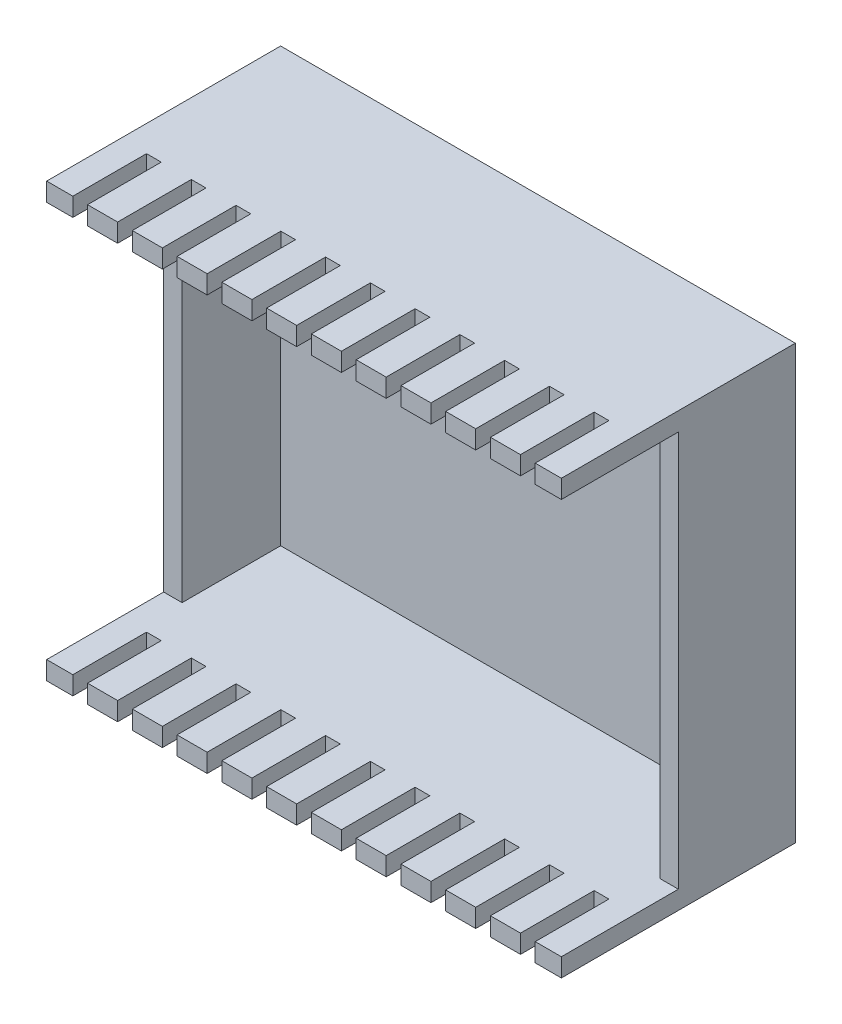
from build123d import *

# Parameters (mm, degrees)
SKETCH1_W           = 27.94
SKETCH1_H           = 23.495
BOSS_EXTRUDE1_DEPTH = 12.7
SKETCH2_W           = 25.94
SKETCH2_H           = 21.495
CUT_EXTRUDE1_DEPTH  = 11.7
SKETCH3_W           = 0.8
SKETCH3_H           = 8
CUT_EXTRUDE2_DEPTH  = 31.140768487
SKETCH4_W           = 36.648147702
SKETCH4_H           = 21.495
CUT_EXTRUDE3_DEPTH  = 6.35


with BuildPart() as part:
    # Sketch1 → Boss-Extrude1 (new body)
    with BuildSketch(Plane.XY):
        Rectangle(SKETCH1_W, SKETCH1_H)
    extrude(amount=BOSS_EXTRUDE1_DEPTH)

    # Sketch2 → Cut-Extrude1 (cut)
    with BuildSketch(Plane.XY.offset(12.7)):
        Rectangle(SKETCH2_W, SKETCH2_H)
    extrude(amount=-CUT_EXTRUDE1_DEPTH, mode=Mode.SUBTRACT)

    # Sketch3 → Cut-Extrude2 (cut, through all)
    with BuildSketch(Plane.XZ.offset(11.7475)):
        with Locations((2.43, 12.7)):
            Rectangle(SKETCH3_W, SKETCH3_H)
        with Locations((0, 12.7)):
            Rectangle(SKETCH3_W, SKETCH3_H)
        with Locations((4.86, 12.7)):
            Rectangle(SKETCH3_W, SKETCH3_H)
        with Locations((7.29, 12.7)):
            Rectangle(SKETCH3_W, SKETCH3_H)
        with Locations((9.72, 12.7)):
            Rectangle(SKETCH3_W, SKETCH3_H)
        with Locations((12.15, 12.7)):
            Rectangle(SKETCH3_W, SKETCH3_H)
        with Locations((-12.15, 12.7)):
            Rectangle(SKETCH3_W, SKETCH3_H)
        with Locations((-9.72, 12.7)):
            Rectangle(SKETCH3_W, SKETCH3_H)
        with Locations((-7.29, 12.7)):
            Rectangle(SKETCH3_W, SKETCH3_H)
        with Locations((-4.86, 12.7)):
            Rectangle(SKETCH3_W, SKETCH3_H)
        with Locations((-2.43, 12.7)):
            Rectangle(SKETCH3_W, SKETCH3_H)
    extrude(amount=-CUT_EXTRUDE2_DEPTH, mode=Mode.SUBTRACT)

    # Sketch4 → Cut-Extrude3 (cut)
    with BuildSketch(Plane.XY.offset(12.7)):
        Rectangle(SKETCH4_W, SKETCH4_H)
    extrude(amount=-CUT_EXTRUDE3_DEPTH, mode=Mode.SUBTRACT)


solid = part.part
